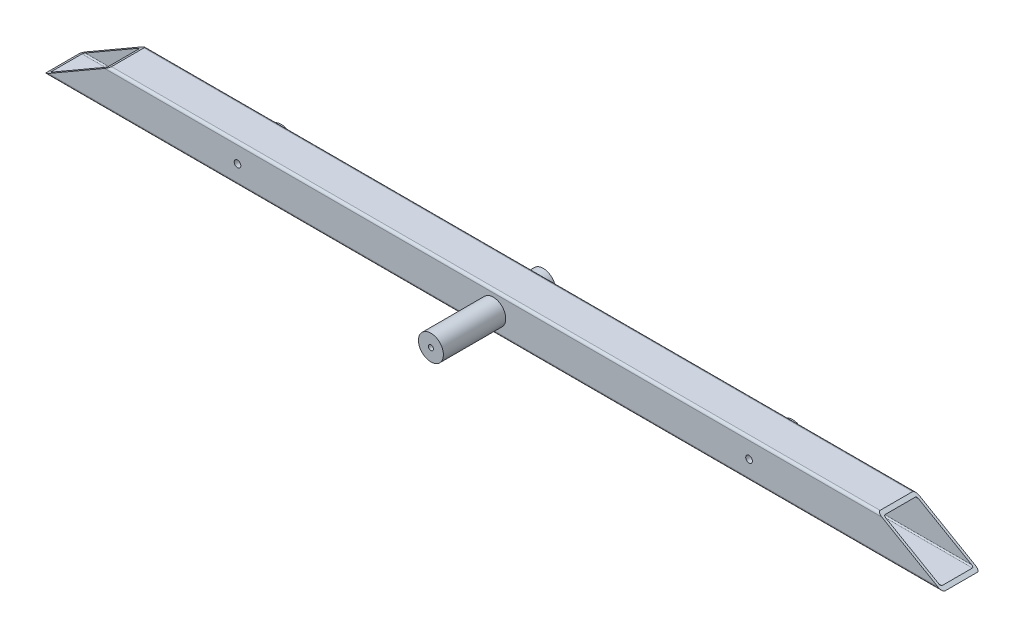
ISO-10303-21;
HEADER;
FILE_DESCRIPTION(('STEP AP214'),'2;1');
FILE_NAME('part.step','',(''),(''),'','','');
FILE_SCHEMA(('AUTOMOTIVE_DESIGN { 1 0 10303 214 1 1 1 1 }'));
ENDSEC;
DATA;
#1=APPLICATION_CONTEXT('core data for automotive mechanical design processes');
#2=APPLICATION_PROTOCOL_DEFINITION('international standard','automotive_design',2000,#1);
#3=PRODUCT_CONTEXT('',#1,'mechanical');
#4=PRODUCT('Part','Part','',(#3));
#5=PRODUCT_RELATED_PRODUCT_CATEGORY('part','',(#4));
#6=PRODUCT_DEFINITION_FORMATION('','',#4);
#7=PRODUCT_DEFINITION_CONTEXT('part definition',#1,'design');
#8=PRODUCT_DEFINITION('design','',#6,#7);
#9=PRODUCT_DEFINITION_SHAPE('','',#8);
#10=(LENGTH_UNIT() NAMED_UNIT(*) SI_UNIT(.MILLI.,.METRE.));
#11=(NAMED_UNIT(*) PLANE_ANGLE_UNIT() SI_UNIT($,.RADIAN.));
#12=(NAMED_UNIT(*) SI_UNIT($,.STERADIAN.) SOLID_ANGLE_UNIT());
#13=UNCERTAINTY_MEASURE_WITH_UNIT(LENGTH_MEASURE(1.E-05),#10,'distance_accuracy_value','');
#14=(GEOMETRIC_REPRESENTATION_CONTEXT(3) GLOBAL_UNCERTAINTY_ASSIGNED_CONTEXT((#13)) GLOBAL_UNIT_ASSIGNED_CONTEXT((#10,
#11,#12)) REPRESENTATION_CONTEXT('',''));
#15=CARTESIAN_POINT('',(0.,0.,0.));
#16=DIRECTION('',(0.,0.,1.));
#17=DIRECTION('',(1.,0.,0.));
#18=AXIS2_PLACEMENT_3D('',#15,#16,#17);
#19=CARTESIAN_POINT('',(457.2,16.51,19.05));
#20=DIRECTION('',(0.,0.,-1.));
#21=DIRECTION('',(-1.,0.,0.));
#22=AXIS2_PLACEMENT_3D('',#19,#20,#21);
#23=PLANE('',#22);
#24=CARTESIAN_POINT('',(260.35,0.,19.05));
#25=DIRECTION('',(0.,0.,-1.));
#26=DIRECTION('',(-1.,0.,0.));
#27=AXIS2_PLACEMENT_3D('',#24,#25,#26);
#28=CIRCLE('',#27,3.3782);
#29=CARTESIAN_POINT('',(256.9718,0.,19.05));
#30=VERTEX_POINT('',#29);
#31=EDGE_CURVE('E346',#30,#30,#28,.T.);
#32=ORIENTED_EDGE('',*,*,#31,.T.);
#33=EDGE_LOOP('',(#32));
#34=FACE_BOUND('',#33,.T.);
#35=CARTESIAN_POINT('',(-260.35,0.,19.05));
#36=DIRECTION('',(0.,0.,-1.));
#37=DIRECTION('',(-1.,0.,0.));
#38=AXIS2_PLACEMENT_3D('',#35,#36,#37);
#39=CIRCLE('',#38,3.3782);
#40=CARTESIAN_POINT('',(-263.7282,0.,19.05));
#41=VERTEX_POINT('',#40);
#42=EDGE_CURVE('E340',#41,#41,#39,.T.);
#43=ORIENTED_EDGE('',*,*,#42,.T.);
#44=EDGE_LOOP('',(#43));
#45=FACE_BOUND('',#44,.T.);
#46=DIRECTION('',(0.866025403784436,0.500000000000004,0.));
#47=VECTOR('',#46,1.);
#48=CARTESIAN_POINT('',(243.997931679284,385.786814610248,19.05));
#49=LINE('',#48,#47);
#50=CARTESIAN_POINT('',(-452.800590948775,-16.51,19.05));
#51=VERTEX_POINT('',#50);
#52=CARTESIAN_POINT('',(-395.608273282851,16.51,19.05));
#53=VERTEX_POINT('',#52);
#54=EDGE_CURVE('E222',#51,#53,#49,.T.);
#55=ORIENTED_EDGE('',*,*,#54,.F.);
#56=DIRECTION('',(-1.,0.,0.));
#57=VECTOR('',#56,1.);
#58=CARTESIAN_POINT('',(457.2,-16.51,19.05));
#59=LINE('',#58,#57);
#60=CARTESIAN_POINT('',(452.800590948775,-16.51,19.05));
#61=VERTEX_POINT('',#60);
#62=EDGE_CURVE('E301',#61,#51,#59,.T.);
#63=ORIENTED_EDGE('',*,*,#62,.F.);
#64=DIRECTION('',(-0.866025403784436,0.500000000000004,0.));
#65=VECTOR('',#64,1.);
#66=CARTESIAN_POINT('',(441.802068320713,-10.1599999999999,19.05));
#67=LINE('',#66,#65);
#68=CARTESIAN_POINT('',(395.608273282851,16.51,19.05));
#69=VERTEX_POINT('',#68);
#70=EDGE_CURVE('E254',#61,#69,#67,.T.);
#71=ORIENTED_EDGE('',*,*,#70,.T.);
#72=DIRECTION('',(-1.,0.,0.));
#73=VECTOR('',#72,1.);
#74=CARTESIAN_POINT('',(457.2,16.51,19.05));
#75=LINE('',#74,#73);
#76=EDGE_CURVE('E304',#69,#53,#75,.T.);
#77=ORIENTED_EDGE('',*,*,#76,.T.);
#78=EDGE_LOOP('',(#55,#63,#71,#77));
#79=FACE_BOUND('',#78,.T.);
#80=CARTESIAN_POINT('',(0.,0.,19.05));
#81=DIRECTION('',(0.,0.,-1.));
#82=DIRECTION('',(-1.,0.,0.));
#83=AXIS2_PLACEMENT_3D('',#80,#81,#82);
#84=CIRCLE('',#83,12.7);
#85=CARTESIAN_POINT('',(-12.7,0.,19.05));
#86=VERTEX_POINT('',#85);
#87=EDGE_CURVE('E188',#86,#86,#84,.F.);
#88=ORIENTED_EDGE('',*,*,#87,.F.);
#89=EDGE_LOOP('',(#88));
#90=FACE_BOUND('',#89,.T.);
#91=ADVANCED_FACE('F37',(#34,#45,#79,#90),#23,.F.);
#92=CARTESIAN_POINT('',(457.2,15.494,16.764));
#93=DIRECTION('',(0.,0.,-1.));
#94=DIRECTION('',(-1.,0.,0.));
#95=AXIS2_PLACEMENT_3D('',#92,#93,#94);
#96=PLANE('',#95);
#97=CARTESIAN_POINT('',(260.35,0.,16.764));
#98=DIRECTION('',(0.,0.,-1.));
#99=DIRECTION('',(-1.,0.,0.));
#100=AXIS2_PLACEMENT_3D('',#97,#98,#99);
#101=CIRCLE('',#100,12.7);
#102=CARTESIAN_POINT('',(247.65,0.,16.764));
#103=VERTEX_POINT('',#102);
#104=EDGE_CURVE('E11',#103,#103,#101,.T.);
#105=ORIENTED_EDGE('',*,*,#104,.F.);
#106=EDGE_LOOP('',(#105));
#107=FACE_BOUND('',#106,.T.);
#108=CARTESIAN_POINT('',(-260.35,0.,16.764));
#109=DIRECTION('',(0.,0.,-1.));
#110=DIRECTION('',(-1.,0.,0.));
#111=AXIS2_PLACEMENT_3D('',#108,#109,#110);
#112=CIRCLE('',#111,12.7);
#113=CARTESIAN_POINT('',(-273.05,0.,16.764));
#114=VERTEX_POINT('',#113);
#115=EDGE_CURVE('E321',#114,#114,#112,.T.);
#116=ORIENTED_EDGE('',*,*,#115,.F.);
#117=EDGE_LOOP('',(#116));
#118=FACE_BOUND('',#117,.T.);
#119=DIRECTION('',(-1.,0.,0.));
#120=VECTOR('',#119,1.);
#121=CARTESIAN_POINT('',(457.2,-15.494,16.764));
#122=LINE('',#121,#120);
#123=CARTESIAN_POINT('',(451.040827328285,-15.494,16.764));
#124=VERTEX_POINT('',#123);
#125=CARTESIAN_POINT('',(-451.040827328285,-15.494,16.764));
#126=VERTEX_POINT('',#125);
#127=EDGE_CURVE('E272',#124,#126,#122,.T.);
#128=ORIENTED_EDGE('',*,*,#127,.T.);
#129=DIRECTION('',(0.866025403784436,0.500000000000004,0.));
#130=VECTOR('',#129,1.);
#131=CARTESIAN_POINT('',(243.557990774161,385.532814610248,16.764));
#132=LINE('',#131,#130);
#133=CARTESIAN_POINT('',(-397.368036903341,15.494,16.764));
#134=VERTEX_POINT('',#133);
#135=EDGE_CURVE('E203',#126,#134,#132,.T.);
#136=ORIENTED_EDGE('',*,*,#135,.T.);
#137=DIRECTION('',(-1.,0.,0.));
#138=VECTOR('',#137,1.);
#139=CARTESIAN_POINT('',(457.2,15.494,16.764));
#140=LINE('',#139,#138);
#141=CARTESIAN_POINT('',(397.368036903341,15.494,16.764));
#142=VERTEX_POINT('',#141);
#143=EDGE_CURVE('E275',#142,#134,#140,.T.);
#144=ORIENTED_EDGE('',*,*,#143,.F.);
#145=DIRECTION('',(-0.866025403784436,0.500000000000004,0.));
#146=VECTOR('',#145,1.);
#147=CARTESIAN_POINT('',(442.242009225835,-10.4139999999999,16.764));
#148=LINE('',#147,#146);
#149=EDGE_CURVE('E234',#124,#142,#148,.T.);
#150=ORIENTED_EDGE('',*,*,#149,.F.);
#151=EDGE_LOOP('',(#128,#136,#144,#150));
#152=FACE_BOUND('',#151,.T.);
#153=CARTESIAN_POINT('',(0.,0.,16.764));
#154=DIRECTION('',(0.,0.,-1.));
#155=DIRECTION('',(-1.,0.,0.));
#156=AXIS2_PLACEMENT_3D('',#153,#154,#155);
#157=CIRCLE('',#156,12.7);
#158=CARTESIAN_POINT('',(-12.7,0.,16.764));
#159=VERTEX_POINT('',#158);
#160=EDGE_CURVE('E187',#159,#159,#157,.F.);
#161=ORIENTED_EDGE('',*,*,#160,.T.);
#162=EDGE_LOOP('',(#161));
#163=FACE_BOUND('',#162,.T.);
#164=ADVANCED_FACE('F422',(#107,#118,#152,#163),#96,.T.);
#165=CARTESIAN_POINT('',(457.2,16.51,-16.51));
#166=DIRECTION('',(-1.,0.,0.));
#167=DIRECTION('',(0.,0.,1.));
#168=AXIS2_PLACEMENT_3D('',#165,#166,#167);
#169=CYLINDRICAL_SURFACE('',#168,2.54);
#170=CARTESIAN_POINT('',(-395.608273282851,16.51,-16.51));
#171=DIRECTION('',(-0.500000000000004,0.866025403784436,0.));
#172=DIRECTION('',(-0.866025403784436,-0.500000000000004,0.));
#173=AXIS2_PLACEMENT_3D('',#170,#171,#172);
#174=ELLIPSE('',#173,5.07999999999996,2.54);
#175=CARTESIAN_POINT('',(-391.208864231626,19.05,-16.51));
#176=VERTEX_POINT('',#175);
#177=CARTESIAN_POINT('',(-395.608273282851,16.51,-19.05));
#178=VERTEX_POINT('',#177);
#179=EDGE_CURVE('E53',#176,#178,#174,.T.);
#180=ORIENTED_EDGE('',*,*,#179,.F.);
#181=DIRECTION('',(-1.,0.,0.));
#182=VECTOR('',#181,1.);
#183=CARTESIAN_POINT('',(457.2,19.05,-16.51));
#184=LINE('',#183,#182);
#185=CARTESIAN_POINT('',(391.208864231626,19.05,-16.51));
#186=VERTEX_POINT('',#185);
#187=EDGE_CURVE('E310',#186,#176,#184,.T.);
#188=ORIENTED_EDGE('',*,*,#187,.F.);
#189=CARTESIAN_POINT('',(395.608273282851,16.51,-16.51));
#190=DIRECTION('',(-0.500000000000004,-0.866025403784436,0.));
#191=DIRECTION('',(-0.866025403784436,0.500000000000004,0.));
#192=AXIS2_PLACEMENT_3D('',#189,#190,#191);
#193=ELLIPSE('',#192,5.07999999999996,2.54);
#194=CARTESIAN_POINT('',(395.608273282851,16.51,-19.05));
#195=VERTEX_POINT('',#194);
#196=EDGE_CURVE('E248',#186,#195,#193,.T.);
#197=ORIENTED_EDGE('',*,*,#196,.T.);
#198=DIRECTION('',(-1.,0.,0.));
#199=VECTOR('',#198,1.);
#200=CARTESIAN_POINT('',(457.2,16.51,-19.05));
#201=LINE('',#200,#199);
#202=EDGE_CURVE('E287',#195,#178,#201,.T.);
#203=ORIENTED_EDGE('',*,*,#202,.T.);
#204=EDGE_LOOP('',(#180,#188,#197,#203));
#205=FACE_BOUND('',#204,.T.);
#206=ADVANCED_FACE('F39',(#205),#169,.T.);
#207=CARTESIAN_POINT('',(457.2,19.05,16.51));
#208=DIRECTION('',(0.,-1.,0.));
#209=DIRECTION('',(0.,0.,-1.));
#210=AXIS2_PLACEMENT_3D('',#207,#208,#209);
#211=PLANE('',#210);
#212=DIRECTION('',(0.,0.,1.));
#213=VECTOR('',#212,1.);
#214=CARTESIAN_POINT('',(-391.208864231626,19.05,-25.4));
#215=LINE('',#214,#213);
#216=CARTESIAN_POINT('',(-391.208864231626,19.05,16.51));
#217=VERTEX_POINT('',#216);
#218=EDGE_CURVE('E193',#176,#217,#215,.T.);
#219=ORIENTED_EDGE('',*,*,#218,.T.);
#220=DIRECTION('',(-1.,0.,0.));
#221=VECTOR('',#220,1.);
#222=CARTESIAN_POINT('',(457.2,19.05,16.51));
#223=LINE('',#222,#221);
#224=CARTESIAN_POINT('',(391.208864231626,19.05,16.51));
#225=VERTEX_POINT('',#224);
#226=EDGE_CURVE('E307',#225,#217,#223,.T.);
#227=ORIENTED_EDGE('',*,*,#226,.F.);
#228=DIRECTION('',(0.,0.,1.));
#229=VECTOR('',#228,1.);
#230=CARTESIAN_POINT('',(391.208864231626,19.05,-25.4));
#231=LINE('',#230,#229);
#232=EDGE_CURVE('E226',#186,#225,#231,.T.);
#233=ORIENTED_EDGE('',*,*,#232,.F.);
#234=ORIENTED_EDGE('',*,*,#187,.T.);
#235=EDGE_LOOP('',(#219,#227,#233,#234));
#236=FACE_BOUND('',#235,.T.);
#237=ADVANCED_FACE('F390',(#236),#211,.F.);
#238=CARTESIAN_POINT('',(457.2,16.51,16.51));
#239=DIRECTION('',(-1.,0.,0.));
#240=DIRECTION('',(0.,0.,1.));
#241=AXIS2_PLACEMENT_3D('',#238,#239,#240);
#242=CYLINDRICAL_SURFACE('',#241,2.54);
#243=CARTESIAN_POINT('',(-395.608273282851,16.51,16.51));
#244=DIRECTION('',(-0.500000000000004,0.866025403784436,0.));
#245=DIRECTION('',(-0.866025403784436,-0.500000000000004,0.));
#246=AXIS2_PLACEMENT_3D('',#243,#244,#245);
#247=ELLIPSE('',#246,5.07999999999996,2.54);
#248=EDGE_CURVE('E224',#53,#217,#247,.T.);
#249=ORIENTED_EDGE('',*,*,#248,.F.);
#250=ORIENTED_EDGE('',*,*,#76,.F.);
#251=CARTESIAN_POINT('',(395.608273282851,16.51,16.51));
#252=DIRECTION('',(-0.500000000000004,-0.866025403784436,0.));
#253=DIRECTION('',(-0.866025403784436,0.500000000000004,0.));
#254=AXIS2_PLACEMENT_3D('',#251,#252,#253);
#255=ELLIPSE('',#254,5.07999999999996,2.54);
#256=EDGE_CURVE('E257',#69,#225,#255,.T.);
#257=ORIENTED_EDGE('',*,*,#256,.T.);
#258=ORIENTED_EDGE('',*,*,#226,.T.);
#259=EDGE_LOOP('',(#249,#250,#257,#258));
#260=FACE_BOUND('',#259,.T.);
#261=ADVANCED_FACE('F393',(#260),#242,.T.);
#262=CARTESIAN_POINT('',(457.2,-16.51,16.51));
#263=DIRECTION('',(-1.,0.,0.));
#264=DIRECTION('',(0.,0.,1.));
#265=AXIS2_PLACEMENT_3D('',#262,#263,#264);
#266=CYLINDRICAL_SURFACE('',#265,2.54);
#267=CARTESIAN_POINT('',(-452.800590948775,-16.51,16.51));
#268=DIRECTION('',(-0.500000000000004,0.866025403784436,0.));
#269=DIRECTION('',(-0.866025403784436,-0.500000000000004,0.));
#270=AXIS2_PLACEMENT_3D('',#267,#268,#269);
#271=ELLIPSE('',#270,5.07999999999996,2.54);
#272=CARTESIAN_POINT('',(-457.2,-19.05,16.51));
#273=VERTEX_POINT('',#272);
#274=EDGE_CURVE('E220',#273,#51,#271,.T.);
#275=ORIENTED_EDGE('',*,*,#274,.F.);
#276=DIRECTION('',(-1.,0.,0.));
#277=VECTOR('',#276,1.);
#278=CARTESIAN_POINT('',(457.2,-19.05,16.51));
#279=LINE('',#278,#277);
#280=CARTESIAN_POINT('',(457.2,-19.05,16.51));
#281=VERTEX_POINT('',#280);
#282=EDGE_CURVE('E298',#281,#273,#279,.T.);
#283=ORIENTED_EDGE('',*,*,#282,.F.);
#284=CARTESIAN_POINT('',(452.800590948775,-16.51,16.51));
#285=DIRECTION('',(-0.500000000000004,-0.866025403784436,0.));
#286=DIRECTION('',(-0.866025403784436,0.500000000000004,0.));
#287=AXIS2_PLACEMENT_3D('',#284,#285,#286);
#288=ELLIPSE('',#287,5.07999999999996,2.54);
#289=EDGE_CURVE('E251',#281,#61,#288,.T.);
#290=ORIENTED_EDGE('',*,*,#289,.T.);
#291=ORIENTED_EDGE('',*,*,#62,.T.);
#292=EDGE_LOOP('',(#275,#283,#290,#291));
#293=FACE_BOUND('',#292,.T.);
#294=ADVANCED_FACE('F401',(#293),#266,.T.);
#295=CARTESIAN_POINT('',(457.2,-16.51,-16.51));
#296=DIRECTION('',(-1.,0.,0.));
#297=DIRECTION('',(0.,0.,1.));
#298=AXIS2_PLACEMENT_3D('',#295,#296,#297);
#299=CYLINDRICAL_SURFACE('',#298,2.54);
#300=CARTESIAN_POINT('',(-452.800590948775,-16.51,-16.51));
#301=DIRECTION('',(-0.500000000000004,0.866025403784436,0.));
#302=DIRECTION('',(-0.866025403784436,-0.500000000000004,0.));
#303=AXIS2_PLACEMENT_3D('',#300,#301,#302);
#304=ELLIPSE('',#303,5.07999999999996,2.54);
#305=CARTESIAN_POINT('',(-452.800590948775,-16.51,-19.05));
#306=VERTEX_POINT('',#305);
#307=CARTESIAN_POINT('',(-457.2,-19.05,-16.51));
#308=VERTEX_POINT('',#307);
#309=EDGE_CURVE('E217',#306,#308,#304,.T.);
#310=ORIENTED_EDGE('',*,*,#309,.F.);
#311=DIRECTION('',(-1.,0.,0.));
#312=VECTOR('',#311,1.);
#313=CARTESIAN_POINT('',(457.2,-16.51,-19.05));
#314=LINE('',#313,#312);
#315=CARTESIAN_POINT('',(452.800590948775,-16.51,-19.05));
#316=VERTEX_POINT('',#315);
#317=EDGE_CURVE('E292',#316,#306,#314,.T.);
#318=ORIENTED_EDGE('',*,*,#317,.F.);
#319=CARTESIAN_POINT('',(452.800590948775,-16.51,-16.51));
#320=DIRECTION('',(-0.500000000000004,-0.866025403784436,0.));
#321=DIRECTION('',(-0.866025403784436,0.500000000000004,0.));
#322=AXIS2_PLACEMENT_3D('',#319,#320,#321);
#323=ELLIPSE('',#322,5.07999999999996,2.54);
#324=CARTESIAN_POINT('',(457.2,-19.05,-16.51));
#325=VERTEX_POINT('',#324);
#326=EDGE_CURVE('E245',#316,#325,#323,.T.);
#327=ORIENTED_EDGE('',*,*,#326,.T.);
#328=DIRECTION('',(-1.,0.,0.));
#329=VECTOR('',#328,1.);
#330=CARTESIAN_POINT('',(457.2,-19.05,-16.51));
#331=LINE('',#330,#329);
#332=EDGE_CURVE('E295',#325,#308,#331,.T.);
#333=ORIENTED_EDGE('',*,*,#332,.T.);
#334=EDGE_LOOP('',(#310,#318,#327,#333));
#335=FACE_BOUND('',#334,.T.);
#336=ADVANCED_FACE('F374',(#335),#299,.T.);
#337=CARTESIAN_POINT('',(457.2,16.51,-19.05));
#338=DIRECTION('',(0.,0.,1.));
#339=DIRECTION('',(0.,-1.,0.));
#340=AXIS2_PLACEMENT_3D('',#337,#338,#339);
#341=PLANE('',#340);
#342=CARTESIAN_POINT('',(260.35,0.,-19.05));
#343=DIRECTION('',(0.,0.,1.));
#344=DIRECTION('',(0.,-1.,0.));
#345=AXIS2_PLACEMENT_3D('',#342,#343,#344);
#346=CIRCLE('',#345,12.7);
#347=CARTESIAN_POINT('',(260.35,-12.7,-19.05));
#348=VERTEX_POINT('',#347);
#349=EDGE_CURVE('E333',#348,#348,#346,.T.);
#350=ORIENTED_EDGE('',*,*,#349,.T.);
#351=EDGE_LOOP('',(#350));
#352=FACE_BOUND('',#351,.T.);
#353=CARTESIAN_POINT('',(-260.35,0.,-19.05));
#354=DIRECTION('',(0.,0.,1.));
#355=DIRECTION('',(0.,-1.,0.));
#356=AXIS2_PLACEMENT_3D('',#353,#354,#355);
#357=CIRCLE('',#356,12.7);
#358=CARTESIAN_POINT('',(-260.35,-12.7,-19.05));
#359=VERTEX_POINT('',#358);
#360=EDGE_CURVE('E172',#359,#359,#357,.T.);
#361=ORIENTED_EDGE('',*,*,#360,.T.);
#362=EDGE_LOOP('',(#361));
#363=FACE_BOUND('',#362,.T.);
#364=CARTESIAN_POINT('',(0.,0.,-19.05));
#365=DIRECTION('',(0.,0.,1.));
#366=DIRECTION('',(0.,-1.,0.));
#367=AXIS2_PLACEMENT_3D('',#364,#365,#366);
#368=CIRCLE('',#367,12.7);
#369=CARTESIAN_POINT('',(0.,-12.7,-19.05));
#370=VERTEX_POINT('',#369);
#371=EDGE_CURVE('E181',#370,#370,#368,.T.);
#372=ORIENTED_EDGE('',*,*,#371,.T.);
#373=EDGE_LOOP('',(#372));
#374=FACE_BOUND('',#373,.T.);
#375=DIRECTION('',(-0.866025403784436,-0.500000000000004,0.));
#376=VECTOR('',#375,1.);
#377=CARTESIAN_POINT('',(243.997931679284,385.786814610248,-19.05));
#378=LINE('',#377,#376);
#379=EDGE_CURVE('E215',#178,#306,#378,.T.);
#380=ORIENTED_EDGE('',*,*,#379,.F.);
#381=ORIENTED_EDGE('',*,*,#202,.F.);
#382=DIRECTION('',(0.866025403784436,-0.500000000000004,0.));
#383=VECTOR('',#382,1.);
#384=CARTESIAN_POINT('',(441.802068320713,-10.1599999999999,-19.05));
#385=LINE('',#384,#383);
#386=EDGE_CURVE('E242',#195,#316,#385,.T.);
#387=ORIENTED_EDGE('',*,*,#386,.T.);
#388=ORIENTED_EDGE('',*,*,#317,.T.);
#389=EDGE_LOOP('',(#380,#381,#387,#388));
#390=FACE_BOUND('',#389,.T.);
#391=ADVANCED_FACE('F370',(#352,#363,#374,#390),#341,.F.);
#392=CARTESIAN_POINT('',(457.2,15.494,-15.494));
#393=DIRECTION('',(-1.,0.,0.));
#394=DIRECTION('',(0.,0.,1.));
#395=AXIS2_PLACEMENT_3D('',#392,#393,#394);
#396=CYLINDRICAL_SURFACE('',#395,1.27);
#397=DIRECTION('',(-1.,0.,0.));
#398=VECTOR('',#397,1.);
#399=CARTESIAN_POINT('',(457.2,16.764,-15.494));
#400=LINE('',#399,#398);
#401=CARTESIAN_POINT('',(395.168332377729,16.764,-15.494));
#402=VERTEX_POINT('',#401);
#403=CARTESIAN_POINT('',(-395.168332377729,16.764,-15.494));
#404=VERTEX_POINT('',#403);
#405=EDGE_CURVE('E281',#402,#404,#400,.T.);
#406=ORIENTED_EDGE('',*,*,#405,.T.);
#407=CARTESIAN_POINT('',(-397.368036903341,15.494,-15.494));
#408=DIRECTION('',(-0.500000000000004,0.866025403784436,0.));
#409=DIRECTION('',(-0.866025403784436,-0.500000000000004,0.));
#410=AXIS2_PLACEMENT_3D('',#407,#408,#409);
#411=ELLIPSE('',#410,2.53999999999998,1.27);
#412=CARTESIAN_POINT('',(-397.368036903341,15.494,-16.764));
#413=VERTEX_POINT('',#412);
#414=EDGE_CURVE('E212',#404,#413,#411,.T.);
#415=ORIENTED_EDGE('',*,*,#414,.T.);
#416=DIRECTION('',(-1.,0.,0.));
#417=VECTOR('',#416,1.);
#418=CARTESIAN_POINT('',(457.2,15.494,-16.764));
#419=LINE('',#418,#417);
#420=CARTESIAN_POINT('',(397.368036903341,15.494,-16.764));
#421=VERTEX_POINT('',#420);
#422=EDGE_CURVE('E260',#421,#413,#419,.T.);
#423=ORIENTED_EDGE('',*,*,#422,.F.);
#424=CARTESIAN_POINT('',(397.368036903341,15.494,-15.494));
#425=DIRECTION('',(-0.500000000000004,-0.866025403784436,0.));
#426=DIRECTION('',(-0.866025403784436,0.500000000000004,0.));
#427=AXIS2_PLACEMENT_3D('',#424,#425,#426);
#428=ELLIPSE('',#427,2.53999999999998,1.27);
#429=EDGE_CURVE('E240',#402,#421,#428,.T.);
#430=ORIENTED_EDGE('',*,*,#429,.F.);
#431=EDGE_LOOP('',(#406,#415,#423,#430));
#432=FACE_BOUND('',#431,.T.);
#433=ADVANCED_FACE('F373',(#432),#396,.F.);
#434=CARTESIAN_POINT('',(457.2,16.764,15.494));
#435=DIRECTION('',(0.,-1.,0.));
#436=DIRECTION('',(0.,0.,-1.));
#437=AXIS2_PLACEMENT_3D('',#434,#435,#436);
#438=PLANE('',#437);
#439=DIRECTION('',(-1.,0.,0.));
#440=VECTOR('',#439,1.);
#441=CARTESIAN_POINT('',(457.2,16.764,15.494));
#442=LINE('',#441,#440);
#443=CARTESIAN_POINT('',(395.168332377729,16.764,15.494));
#444=VERTEX_POINT('',#443);
#445=CARTESIAN_POINT('',(-395.168332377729,16.764,15.494));
#446=VERTEX_POINT('',#445);
#447=EDGE_CURVE('E278',#444,#446,#442,.T.);
#448=ORIENTED_EDGE('',*,*,#447,.T.);
#449=DIRECTION('',(0.,0.,-1.));
#450=VECTOR('',#449,1.);
#451=CARTESIAN_POINT('',(-395.168332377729,16.764,15.4940000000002));
#452=LINE('',#451,#450);
#453=EDGE_CURVE('E209',#446,#404,#452,.T.);
#454=ORIENTED_EDGE('',*,*,#453,.T.);
#455=ORIENTED_EDGE('',*,*,#405,.F.);
#456=DIRECTION('',(0.,0.,-1.));
#457=VECTOR('',#456,1.);
#458=CARTESIAN_POINT('',(395.168332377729,16.764,15.494));
#459=LINE('',#458,#457);
#460=EDGE_CURVE('E238',#444,#402,#459,.T.);
#461=ORIENTED_EDGE('',*,*,#460,.F.);
#462=EDGE_LOOP('',(#448,#454,#455,#461));
#463=FACE_BOUND('',#462,.T.);
#464=ADVANCED_FACE('F622',(#463),#438,.T.);
#465=CARTESIAN_POINT('',(457.2,15.494,15.494));
#466=DIRECTION('',(-1.,0.,0.));
#467=DIRECTION('',(0.,0.,1.));
#468=AXIS2_PLACEMENT_3D('',#465,#466,#467);
#469=CYLINDRICAL_SURFACE('',#468,1.27);
#470=ORIENTED_EDGE('',*,*,#143,.T.);
#471=CARTESIAN_POINT('',(-397.368036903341,15.494,15.494));
#472=DIRECTION('',(-0.500000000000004,0.866025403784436,0.));
#473=DIRECTION('',(-0.866025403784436,-0.500000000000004,0.));
#474=AXIS2_PLACEMENT_3D('',#471,#472,#473);
#475=ELLIPSE('',#474,2.53999999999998,1.27);
#476=EDGE_CURVE('E206',#134,#446,#475,.T.);
#477=ORIENTED_EDGE('',*,*,#476,.T.);
#478=ORIENTED_EDGE('',*,*,#447,.F.);
#479=CARTESIAN_POINT('',(397.368036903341,15.494,15.494));
#480=DIRECTION('',(-0.500000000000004,-0.866025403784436,0.));
#481=DIRECTION('',(-0.866025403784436,0.500000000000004,0.));
#482=AXIS2_PLACEMENT_3D('',#479,#480,#481);
#483=ELLIPSE('',#482,2.53999999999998,1.27);
#484=EDGE_CURVE('E236',#142,#444,#483,.T.);
#485=ORIENTED_EDGE('',*,*,#484,.F.);
#486=EDGE_LOOP('',(#470,#477,#478,#485));
#487=FACE_BOUND('',#486,.T.);
#488=ADVANCED_FACE('F629',(#487),#469,.F.);
#489=CARTESIAN_POINT('',(457.2,-15.494,15.494));
#490=DIRECTION('',(-1.,0.,0.));
#491=DIRECTION('',(0.,0.,1.));
#492=AXIS2_PLACEMENT_3D('',#489,#490,#491);
#493=CYLINDRICAL_SURFACE('',#492,1.27);
#494=DIRECTION('',(-1.,0.,0.));
#495=VECTOR('',#494,1.);
#496=CARTESIAN_POINT('',(457.2,-16.764,15.494));
#497=LINE('',#496,#495);
#498=CARTESIAN_POINT('',(453.240531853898,-16.764,15.494));
#499=VERTEX_POINT('',#498);
#500=CARTESIAN_POINT('',(-453.240531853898,-16.764,15.494));
#501=VERTEX_POINT('',#500);
#502=EDGE_CURVE('E269',#499,#501,#497,.T.);
#503=ORIENTED_EDGE('',*,*,#502,.T.);
#504=CARTESIAN_POINT('',(-451.040827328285,-15.494,15.494));
#505=DIRECTION('',(-0.500000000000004,0.866025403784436,0.));
#506=DIRECTION('',(-0.866025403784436,-0.500000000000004,0.));
#507=AXIS2_PLACEMENT_3D('',#504,#505,#506);
#508=ELLIPSE('',#507,2.53999999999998,1.27);
#509=EDGE_CURVE('E200',#501,#126,#508,.T.);
#510=ORIENTED_EDGE('',*,*,#509,.T.);
#511=ORIENTED_EDGE('',*,*,#127,.F.);
#512=CARTESIAN_POINT('',(451.040827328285,-15.494,15.494));
#513=DIRECTION('',(-0.500000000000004,-0.866025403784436,0.));
#514=DIRECTION('',(-0.866025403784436,0.500000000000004,0.));
#515=AXIS2_PLACEMENT_3D('',#512,#513,#514);
#516=ELLIPSE('',#515,2.53999999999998,1.27);
#517=EDGE_CURVE('E232',#499,#124,#516,.T.);
#518=ORIENTED_EDGE('',*,*,#517,.F.);
#519=EDGE_LOOP('',(#503,#510,#511,#518));
#520=FACE_BOUND('',#519,.T.);
#521=ADVANCED_FACE('F637',(#520),#493,.F.);
#522=CARTESIAN_POINT('',(457.2,-16.764,15.494));
#523=DIRECTION('',(0.,1.,0.));
#524=DIRECTION('',(0.,0.,1.));
#525=AXIS2_PLACEMENT_3D('',#522,#523,#524);
#526=PLANE('',#525);
#527=DIRECTION('',(-1.,0.,0.));
#528=VECTOR('',#527,1.);
#529=CARTESIAN_POINT('',(457.2,-16.764,-15.494));
#530=LINE('',#529,#528);
#531=CARTESIAN_POINT('',(453.240531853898,-16.764,-15.494));
#532=VERTEX_POINT('',#531);
#533=CARTESIAN_POINT('',(-453.240531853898,-16.764,-15.494));
#534=VERTEX_POINT('',#533);
#535=EDGE_CURVE('E266',#532,#534,#530,.T.);
#536=ORIENTED_EDGE('',*,*,#535,.T.);
#537=DIRECTION('',(0.,0.,1.));
#538=VECTOR('',#537,1.);
#539=CARTESIAN_POINT('',(-453.240531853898,-16.764,15.4939999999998));
#540=LINE('',#539,#538);
#541=EDGE_CURVE('E197',#534,#501,#540,.T.);
#542=ORIENTED_EDGE('',*,*,#541,.T.);
#543=ORIENTED_EDGE('',*,*,#502,.F.);
#544=DIRECTION('',(0.,0.,1.));
#545=VECTOR('',#544,1.);
#546=CARTESIAN_POINT('',(453.240531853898,-16.764,15.494));
#547=LINE('',#546,#545);
#548=EDGE_CURVE('E230',#532,#499,#547,.T.);
#549=ORIENTED_EDGE('',*,*,#548,.F.);
#550=EDGE_LOOP('',(#536,#542,#543,#549));
#551=FACE_BOUND('',#550,.T.);
#552=ADVANCED_FACE('F645',(#551),#526,.T.);
#553=CARTESIAN_POINT('',(457.2,-15.494,-15.494));
#554=DIRECTION('',(-1.,0.,0.));
#555=DIRECTION('',(0.,0.,1.));
#556=AXIS2_PLACEMENT_3D('',#553,#554,#555);
#557=CYLINDRICAL_SURFACE('',#556,1.27);
#558=DIRECTION('',(-1.,0.,0.));
#559=VECTOR('',#558,1.);
#560=CARTESIAN_POINT('',(457.2,-15.494,-16.764));
#561=LINE('',#560,#559);
#562=CARTESIAN_POINT('',(451.040827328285,-15.494,-16.764));
#563=VERTEX_POINT('',#562);
#564=CARTESIAN_POINT('',(-451.040827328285,-15.494,-16.764));
#565=VERTEX_POINT('',#564);
#566=EDGE_CURVE('E263',#563,#565,#561,.T.);
#567=ORIENTED_EDGE('',*,*,#566,.T.);
#568=CARTESIAN_POINT('',(-451.040827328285,-15.494,-15.494));
#569=DIRECTION('',(-0.500000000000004,0.866025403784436,0.));
#570=DIRECTION('',(-0.866025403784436,-0.500000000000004,0.));
#571=AXIS2_PLACEMENT_3D('',#568,#569,#570);
#572=ELLIPSE('',#571,2.53999999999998,1.27);
#573=EDGE_CURVE('E61',#565,#534,#572,.T.);
#574=ORIENTED_EDGE('',*,*,#573,.T.);
#575=ORIENTED_EDGE('',*,*,#535,.F.);
#576=CARTESIAN_POINT('',(451.040827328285,-15.494,-15.494));
#577=DIRECTION('',(-0.500000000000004,-0.866025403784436,0.));
#578=DIRECTION('',(-0.866025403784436,0.500000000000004,0.));
#579=AXIS2_PLACEMENT_3D('',#576,#577,#578);
#580=ELLIPSE('',#579,2.53999999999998,1.27);
#581=EDGE_CURVE('E228',#563,#532,#580,.T.);
#582=ORIENTED_EDGE('',*,*,#581,.F.);
#583=EDGE_LOOP('',(#567,#574,#575,#582));
#584=FACE_BOUND('',#583,.T.);
#585=ADVANCED_FACE('F599',(#584),#557,.F.);
#586=CARTESIAN_POINT('',(457.2,15.494,-16.764));
#587=DIRECTION('',(0.,0.,1.));
#588=DIRECTION('',(0.,-1.,0.));
#589=AXIS2_PLACEMENT_3D('',#586,#587,#588);
#590=PLANE('',#589);
#591=CARTESIAN_POINT('',(260.35,0.,-16.764));
#592=DIRECTION('',(0.,0.,1.));
#593=DIRECTION('',(0.,-1.,0.));
#594=AXIS2_PLACEMENT_3D('',#591,#592,#593);
#595=CIRCLE('',#594,12.7);
#596=CARTESIAN_POINT('',(260.35,-12.7,-16.764));
#597=VERTEX_POINT('',#596);
#598=EDGE_CURVE('E41',#597,#597,#595,.T.);
#599=ORIENTED_EDGE('',*,*,#598,.F.);
#600=EDGE_LOOP('',(#599));
#601=FACE_BOUND('',#600,.T.);
#602=CARTESIAN_POINT('',(-260.35,0.,-16.764));
#603=DIRECTION('',(0.,0.,1.));
#604=DIRECTION('',(0.,-1.,0.));
#605=AXIS2_PLACEMENT_3D('',#602,#603,#604);
#606=CIRCLE('',#605,12.7);
#607=CARTESIAN_POINT('',(-260.35,-12.7,-16.764));
#608=VERTEX_POINT('',#607);
#609=EDGE_CURVE('E319',#608,#608,#606,.T.);
#610=ORIENTED_EDGE('',*,*,#609,.F.);
#611=EDGE_LOOP('',(#610));
#612=FACE_BOUND('',#611,.T.);
#613=CARTESIAN_POINT('',(0.,0.,-16.764));
#614=DIRECTION('',(0.,0.,1.));
#615=DIRECTION('',(0.,-1.,0.));
#616=AXIS2_PLACEMENT_3D('',#613,#614,#615);
#617=CIRCLE('',#616,12.7);
#618=CARTESIAN_POINT('',(0.,-12.7,-16.764));
#619=VERTEX_POINT('',#618);
#620=EDGE_CURVE('E191',#619,#619,#617,.T.);
#621=ORIENTED_EDGE('',*,*,#620,.F.);
#622=EDGE_LOOP('',(#621));
#623=FACE_BOUND('',#622,.T.);
#624=ORIENTED_EDGE('',*,*,#422,.T.);
#625=DIRECTION('',(-0.866025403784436,-0.500000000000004,0.));
#626=VECTOR('',#625,1.);
#627=CARTESIAN_POINT('',(243.557990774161,385.532814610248,-16.7640000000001));
#628=LINE('',#627,#626);
#629=EDGE_CURVE('E192',#413,#565,#628,.T.);
#630=ORIENTED_EDGE('',*,*,#629,.T.);
#631=ORIENTED_EDGE('',*,*,#566,.F.);
#632=DIRECTION('',(0.866025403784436,-0.500000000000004,0.));
#633=VECTOR('',#632,1.);
#634=CARTESIAN_POINT('',(442.242009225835,-10.4139999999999,-16.764));
#635=LINE('',#634,#633);
#636=EDGE_CURVE('E313',#421,#563,#635,.T.);
#637=ORIENTED_EDGE('',*,*,#636,.F.);
#638=EDGE_LOOP('',(#624,#630,#631,#637));
#639=FACE_BOUND('',#638,.T.);
#640=ADVANCED_FACE('F596',(#601,#612,#623,#639),#590,.T.);
#641=CARTESIAN_POINT('',(457.2,-19.05,16.51));
#642=DIRECTION('',(0.,1.,0.));
#643=DIRECTION('',(0.,0.,1.));
#644=AXIS2_PLACEMENT_3D('',#641,#642,#643);
#645=PLANE('',#644);
#646=DIRECTION('',(0.,0.,-1.));
#647=VECTOR('',#646,1.);
#648=CARTESIAN_POINT('',(-457.2,-19.05,16.51));
#649=LINE('',#648,#647);
#650=EDGE_CURVE('E284',#273,#308,#649,.T.);
#651=ORIENTED_EDGE('',*,*,#650,.T.);
#652=ORIENTED_EDGE('',*,*,#332,.F.);
#653=DIRECTION('',(0.,0.,-1.));
#654=VECTOR('',#653,1.);
#655=CARTESIAN_POINT('',(457.2,-19.05,16.51));
#656=LINE('',#655,#654);
#657=EDGE_CURVE('E285',#281,#325,#656,.T.);
#658=ORIENTED_EDGE('',*,*,#657,.F.);
#659=ORIENTED_EDGE('',*,*,#282,.T.);
#660=EDGE_LOOP('',(#651,#652,#658,#659));
#661=FACE_BOUND('',#660,.T.);
#662=ADVANCED_FACE('F407',(#661),#645,.F.);
#663=CARTESIAN_POINT('',(391.208864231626,19.05,-25.4));
#664=DIRECTION('',(-0.500000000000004,-0.866025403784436,0.));
#665=DIRECTION('',(0.866025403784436,-0.500000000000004,0.));
#666=AXIS2_PLACEMENT_3D('',#663,#664,#665);
#667=PLANE('',#666);
#668=ORIENTED_EDGE('',*,*,#429,.T.);
#669=ORIENTED_EDGE('',*,*,#636,.T.);
#670=ORIENTED_EDGE('',*,*,#581,.T.);
#671=ORIENTED_EDGE('',*,*,#548,.T.);
#672=ORIENTED_EDGE('',*,*,#517,.T.);
#673=ORIENTED_EDGE('',*,*,#149,.T.);
#674=ORIENTED_EDGE('',*,*,#484,.T.);
#675=ORIENTED_EDGE('',*,*,#460,.T.);
#676=EDGE_LOOP('',(#668,#669,#670,#671,#672,#673,#674,#675));
#677=FACE_BOUND('',#676,.T.);
#678=ORIENTED_EDGE('',*,*,#70,.F.);
#679=ORIENTED_EDGE('',*,*,#289,.F.);
#680=ORIENTED_EDGE('',*,*,#657,.T.);
#681=ORIENTED_EDGE('',*,*,#326,.F.);
#682=ORIENTED_EDGE('',*,*,#386,.F.);
#683=ORIENTED_EDGE('',*,*,#196,.F.);
#684=ORIENTED_EDGE('',*,*,#232,.T.);
#685=ORIENTED_EDGE('',*,*,#256,.F.);
#686=EDGE_LOOP('',(#678,#679,#680,#681,#682,#683,#684,#685));
#687=FACE_BOUND('',#686,.T.);
#688=ADVANCED_FACE('F387',(#677,#687),#667,.F.);
#689=CARTESIAN_POINT('',(-391.208864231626,19.05,-25.4));
#690=DIRECTION('',(-0.500000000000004,0.866025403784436,0.));
#691=DIRECTION('',(-0.866025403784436,-0.500000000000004,0.));
#692=AXIS2_PLACEMENT_3D('',#689,#690,#691);
#693=PLANE('',#692);
#694=ORIENTED_EDGE('',*,*,#453,.F.);
#695=ORIENTED_EDGE('',*,*,#476,.F.);
#696=ORIENTED_EDGE('',*,*,#135,.F.);
#697=ORIENTED_EDGE('',*,*,#509,.F.);
#698=ORIENTED_EDGE('',*,*,#541,.F.);
#699=ORIENTED_EDGE('',*,*,#573,.F.);
#700=ORIENTED_EDGE('',*,*,#629,.F.);
#701=ORIENTED_EDGE('',*,*,#414,.F.);
#702=EDGE_LOOP('',(#694,#695,#696,#697,#698,#699,#700,#701));
#703=FACE_BOUND('',#702,.T.);
#704=ORIENTED_EDGE('',*,*,#248,.T.);
#705=ORIENTED_EDGE('',*,*,#218,.F.);
#706=ORIENTED_EDGE('',*,*,#179,.T.);
#707=ORIENTED_EDGE('',*,*,#379,.T.);
#708=ORIENTED_EDGE('',*,*,#309,.T.);
#709=ORIENTED_EDGE('',*,*,#650,.F.);
#710=ORIENTED_EDGE('',*,*,#274,.T.);
#711=ORIENTED_EDGE('',*,*,#54,.T.);
#712=EDGE_LOOP('',(#704,#705,#706,#707,#708,#709,#710,#711));
#713=FACE_BOUND('',#712,.T.);
#714=ADVANCED_FACE('F408',(#703,#713),#693,.T.);
#715=CARTESIAN_POINT('',(0.,0.,82.55));
#716=DIRECTION('',(0.,0.,-1.));
#717=DIRECTION('',(-1.,0.,0.));
#718=AXIS2_PLACEMENT_3D('',#715,#716,#717);
#719=CYLINDRICAL_SURFACE('',#718,12.7);
#720=ORIENTED_EDGE('',*,*,#160,.F.);
#721=EDGE_LOOP('',(#720));
#722=FACE_BOUND('',#721,.T.);
#723=ORIENTED_EDGE('',*,*,#620,.T.);
#724=EDGE_LOOP('',(#723));
#725=FACE_BOUND('',#724,.T.);
#726=ADVANCED_FACE('F410',(#722,#725),#719,.T.);
#727=CARTESIAN_POINT('',(0.,0.,82.55));
#728=DIRECTION('',(0.,0.,1.));
#729=DIRECTION('',(1.,0.,0.));
#730=AXIS2_PLACEMENT_3D('',#727,#728,#729);
#731=CIRCLE('',#730,12.7);
#732=CARTESIAN_POINT('',(12.7,0.,82.55));
#733=VERTEX_POINT('',#732);
#734=EDGE_CURVE('E184',#733,#733,#731,.T.);
#735=ORIENTED_EDGE('',*,*,#734,.F.);
#736=EDGE_LOOP('',(#735));
#737=FACE_BOUND('',#736,.T.);
#738=ORIENTED_EDGE('',*,*,#87,.T.);
#739=EDGE_LOOP('',(#738));
#740=FACE_BOUND('',#739,.T.);
#741=ADVANCED_FACE('F416',(#737,#740),#719,.T.);
#742=CARTESIAN_POINT('',(0.,0.,82.55));
#743=DIRECTION('',(0.,0.,1.));
#744=DIRECTION('',(1.,0.,0.));
#745=AXIS2_PLACEMENT_3D('',#742,#743,#744);
#746=PLANE('',#745);
#747=CARTESIAN_POINT('',(0.,0.,82.55));
#748=DIRECTION('',(0.,0.,1.));
#749=DIRECTION('',(1.,0.,0.));
#750=AXIS2_PLACEMENT_3D('',#747,#748,#749);
#751=CIRCLE('',#750,2.5527);
#752=CARTESIAN_POINT('',(2.5527,0.,82.55));
#753=VERTEX_POINT('',#752);
#754=EDGE_CURVE('E166',#753,#753,#751,.T.);
#755=ORIENTED_EDGE('',*,*,#754,.F.);
#756=EDGE_LOOP('',(#755));
#757=FACE_BOUND('',#756,.T.);
#758=ORIENTED_EDGE('',*,*,#734,.T.);
#759=EDGE_LOOP('',(#758));
#760=FACE_BOUND('',#759,.T.);
#761=ADVANCED_FACE('F472',(#757,#760),#746,.T.);
#762=CARTESIAN_POINT('',(0.,0.,-31.75));
#763=DIRECTION('',(0.,0.,1.));
#764=DIRECTION('',(1.,0.,0.));
#765=AXIS2_PLACEMENT_3D('',#762,#763,#764);
#766=CYLINDRICAL_SURFACE('',#765,12.7);
#767=CARTESIAN_POINT('',(0.,0.,-31.75));
#768=DIRECTION('',(0.,0.,1.));
#769=DIRECTION('',(1.,0.,0.));
#770=AXIS2_PLACEMENT_3D('',#767,#768,#769);
#771=CIRCLE('',#770,12.7);
#772=CARTESIAN_POINT('',(12.7,0.,-31.75));
#773=VERTEX_POINT('',#772);
#774=EDGE_CURVE('E178',#773,#773,#771,.T.);
#775=ORIENTED_EDGE('',*,*,#774,.T.);
#776=EDGE_LOOP('',(#775));
#777=FACE_BOUND('',#776,.T.);
#778=ORIENTED_EDGE('',*,*,#371,.F.);
#779=EDGE_LOOP('',(#778));
#780=FACE_BOUND('',#779,.T.);
#781=ADVANCED_FACE('F479',(#777,#780),#766,.T.);
#782=CARTESIAN_POINT('',(0.,0.,-31.75));
#783=DIRECTION('',(0.,0.,1.));
#784=DIRECTION('',(1.,0.,0.));
#785=AXIS2_PLACEMENT_3D('',#782,#783,#784);
#786=PLANE('',#785);
#787=CARTESIAN_POINT('',(0.,0.,-31.75));
#788=DIRECTION('',(0.,0.,-1.));
#789=DIRECTION('',(-1.,0.,0.));
#790=AXIS2_PLACEMENT_3D('',#787,#788,#789);
#791=CIRCLE('',#790,3.96875);
#792=CARTESIAN_POINT('',(-3.96875,0.,-31.75));
#793=VERTEX_POINT('',#792);
#794=EDGE_CURVE('E165',#793,#793,#791,.T.);
#795=ORIENTED_EDGE('',*,*,#794,.F.);
#796=EDGE_LOOP('',(#795));
#797=FACE_BOUND('',#796,.T.);
#798=ORIENTED_EDGE('',*,*,#774,.F.);
#799=EDGE_LOOP('',(#798));
#800=FACE_BOUND('',#799,.T.);
#801=ADVANCED_FACE('F519',(#797,#800),#786,.F.);
#802=CARTESIAN_POINT('',(0.,0.,-4.7498));
#803=DIRECTION('',(0.,0.,-1.));
#804=DIRECTION('',(-1.,0.,0.));
#805=AXIS2_PLACEMENT_3D('',#802,#803,#804);
#806=CONICAL_SURFACE('',#805,3.96875,1.02974425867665);
#807=CARTESIAN_POINT('',(0.,0.,-2.36513441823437));
#808=VERTEX_POINT('',#807);
#809=VERTEX_LOOP('',#808);
#810=FACE_BOUND('',#809,.T.);
#811=CARTESIAN_POINT('',(0.,0.,-4.7498));
#812=DIRECTION('',(0.,0.,-1.));
#813=DIRECTION('',(-1.,0.,0.));
#814=AXIS2_PLACEMENT_3D('',#811,#812,#813);
#815=CIRCLE('',#814,3.96875);
#816=CARTESIAN_POINT('',(-3.96875,0.,-4.7498));
#817=VERTEX_POINT('',#816);
#818=EDGE_CURVE('E169',#817,#817,#815,.T.);
#819=ORIENTED_EDGE('',*,*,#818,.T.);
#820=EDGE_LOOP('',(#819));
#821=FACE_BOUND('',#820,.T.);
#822=ADVANCED_FACE('F511',(#810,#821),#806,.F.);
#823=CARTESIAN_POINT('',(0.,0.,-31.75));
#824=DIRECTION('',(0.,0.,-1.));
#825=DIRECTION('',(-1.,0.,0.));
#826=AXIS2_PLACEMENT_3D('',#823,#824,#825);
#827=CYLINDRICAL_SURFACE('',#826,3.96875);
#828=ORIENTED_EDGE('',*,*,#818,.F.);
#829=EDGE_LOOP('',(#828));
#830=FACE_BOUND('',#829,.T.);
#831=ORIENTED_EDGE('',*,*,#794,.T.);
#832=EDGE_LOOP('',(#831));
#833=FACE_BOUND('',#832,.T.);
#834=ADVANCED_FACE('F159',(#830,#833),#827,.F.);
#835=CARTESIAN_POINT('',(0.,0.,63.5));
#836=DIRECTION('',(0.,0.,1.));
#837=DIRECTION('',(1.,0.,0.));
#838=AXIS2_PLACEMENT_3D('',#835,#836,#837);
#839=CONICAL_SURFACE('',#838,2.55269999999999,1.02974425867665);
#840=CARTESIAN_POINT('',(0.,0.,61.9661830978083));
#841=VERTEX_POINT('',#840);
#842=VERTEX_LOOP('',#841);
#843=FACE_BOUND('',#842,.T.);
#844=CARTESIAN_POINT('',(0.,0.,63.5));
#845=DIRECTION('',(0.,0.,1.));
#846=DIRECTION('',(1.,0.,0.));
#847=AXIS2_PLACEMENT_3D('',#844,#845,#846);
#848=CIRCLE('',#847,2.55269999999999);
#849=CARTESIAN_POINT('',(2.55269999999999,0.,63.5));
#850=VERTEX_POINT('',#849);
#851=EDGE_CURVE('E163',#850,#850,#848,.T.);
#852=ORIENTED_EDGE('',*,*,#851,.T.);
#853=EDGE_LOOP('',(#852));
#854=FACE_BOUND('',#853,.T.);
#855=ADVANCED_FACE('F155',(#843,#854),#839,.F.);
#856=CARTESIAN_POINT('',(0.,0.,82.55));
#857=DIRECTION('',(0.,0.,1.));
#858=DIRECTION('',(1.,0.,0.));
#859=AXIS2_PLACEMENT_3D('',#856,#857,#858);
#860=CYLINDRICAL_SURFACE('',#859,2.5527);
#861=ORIENTED_EDGE('',*,*,#851,.F.);
#862=EDGE_LOOP('',(#861));
#863=FACE_BOUND('',#862,.T.);
#864=ORIENTED_EDGE('',*,*,#754,.T.);
#865=EDGE_LOOP('',(#864));
#866=FACE_BOUND('',#865,.T.);
#867=ADVANCED_FACE('F158',(#863,#866),#860,.F.);
#868=CARTESIAN_POINT('',(-260.35,0.,-25.4));
#869=DIRECTION('',(0.,0.,1.));
#870=DIRECTION('',(1.,0.,0.));
#871=AXIS2_PLACEMENT_3D('',#868,#869,#870);
#872=CYLINDRICAL_SURFACE('',#871,12.7);
#873=ORIENTED_EDGE('',*,*,#115,.T.);
#874=EDGE_LOOP('',(#873));
#875=FACE_BOUND('',#874,.T.);
#876=ORIENTED_EDGE('',*,*,#609,.T.);
#877=EDGE_LOOP('',(#876));
#878=FACE_BOUND('',#877,.T.);
#879=ADVANCED_FACE('F501',(#875,#878),#872,.T.);
#880=CARTESIAN_POINT('',(-260.35,0.,-25.4));
#881=DIRECTION('',(0.,0.,1.));
#882=DIRECTION('',(1.,0.,0.));
#883=AXIS2_PLACEMENT_3D('',#880,#881,#882);
#884=CIRCLE('',#883,12.7);
#885=CARTESIAN_POINT('',(-247.65,0.,-25.4));
#886=VERTEX_POINT('',#885);
#887=EDGE_CURVE('E331',#886,#886,#884,.T.);
#888=ORIENTED_EDGE('',*,*,#887,.T.);
#889=EDGE_LOOP('',(#888));
#890=FACE_BOUND('',#889,.T.);
#891=ORIENTED_EDGE('',*,*,#360,.F.);
#892=EDGE_LOOP('',(#891));
#893=FACE_BOUND('',#892,.T.);
#894=ADVANCED_FACE('F550',(#890,#893),#872,.T.);
#895=CARTESIAN_POINT('',(-260.35,0.,-25.4));
#896=DIRECTION('',(0.,0.,1.));
#897=DIRECTION('',(1.,0.,0.));
#898=AXIS2_PLACEMENT_3D('',#895,#896,#897);
#899=PLANE('',#898);
#900=CARTESIAN_POINT('',(-260.35,0.,-25.4));
#901=DIRECTION('',(0.,0.,-1.));
#902=DIRECTION('',(-1.,0.,0.));
#903=AXIS2_PLACEMENT_3D('',#900,#901,#902);
#904=CIRCLE('',#903,3.3782);
#905=CARTESIAN_POINT('',(-263.7282,0.,-25.4));
#906=VERTEX_POINT('',#905);
#907=EDGE_CURVE('E343',#906,#906,#904,.T.);
#908=ORIENTED_EDGE('',*,*,#907,.F.);
#909=EDGE_LOOP('',(#908));
#910=FACE_BOUND('',#909,.T.);
#911=ORIENTED_EDGE('',*,*,#887,.F.);
#912=EDGE_LOOP('',(#911));
#913=FACE_BOUND('',#912,.T.);
#914=ADVANCED_FACE('F551',(#910,#913),#899,.F.);
#915=CARTESIAN_POINT('',(260.35,0.,-25.4));
#916=DIRECTION('',(0.,0.,1.));
#917=DIRECTION('',(1.,0.,0.));
#918=AXIS2_PLACEMENT_3D('',#915,#916,#917);
#919=CYLINDRICAL_SURFACE('',#918,12.7);
#920=ORIENTED_EDGE('',*,*,#104,.T.);
#921=EDGE_LOOP('',(#920));
#922=FACE_BOUND('',#921,.T.);
#923=ORIENTED_EDGE('',*,*,#598,.T.);
#924=EDGE_LOOP('',(#923));
#925=FACE_BOUND('',#924,.T.);
#926=ADVANCED_FACE('F366',(#922,#925),#919,.T.);
#927=CARTESIAN_POINT('',(260.35,0.,-25.4));
#928=DIRECTION('',(0.,0.,1.));
#929=DIRECTION('',(1.,0.,0.));
#930=AXIS2_PLACEMENT_3D('',#927,#928,#929);
#931=CIRCLE('',#930,12.7);
#932=CARTESIAN_POINT('',(273.05,0.,-25.4));
#933=VERTEX_POINT('',#932);
#934=EDGE_CURVE('E337',#933,#933,#931,.T.);
#935=ORIENTED_EDGE('',*,*,#934,.T.);
#936=EDGE_LOOP('',(#935));
#937=FACE_BOUND('',#936,.T.);
#938=ORIENTED_EDGE('',*,*,#349,.F.);
#939=EDGE_LOOP('',(#938));
#940=FACE_BOUND('',#939,.T.);
#941=ADVANCED_FACE('F360',(#937,#940),#919,.T.);
#942=CARTESIAN_POINT('',(260.35,0.,-25.4));
#943=DIRECTION('',(0.,0.,1.));
#944=DIRECTION('',(1.,0.,0.));
#945=AXIS2_PLACEMENT_3D('',#942,#943,#944);
#946=PLANE('',#945);
#947=CARTESIAN_POINT('',(260.35,0.,-25.4));
#948=DIRECTION('',(0.,0.,-1.));
#949=DIRECTION('',(-1.,0.,0.));
#950=AXIS2_PLACEMENT_3D('',#947,#948,#949);
#951=CIRCLE('',#950,3.3782);
#952=CARTESIAN_POINT('',(256.9718,0.,-25.4));
#953=VERTEX_POINT('',#952);
#954=EDGE_CURVE('E349',#953,#953,#951,.T.);
#955=ORIENTED_EDGE('',*,*,#954,.F.);
#956=EDGE_LOOP('',(#955));
#957=FACE_BOUND('',#956,.T.);
#958=ORIENTED_EDGE('',*,*,#934,.F.);
#959=EDGE_LOOP('',(#958));
#960=FACE_BOUND('',#959,.T.);
#961=ADVANCED_FACE('F356',(#957,#960),#946,.F.);
#962=CARTESIAN_POINT('',(-260.35,0.,-25.4));
#963=DIRECTION('',(0.,0.,-1.));
#964=DIRECTION('',(-1.,0.,0.));
#965=AXIS2_PLACEMENT_3D('',#962,#963,#964);
#966=CYLINDRICAL_SURFACE('',#965,3.3782);
#967=ORIENTED_EDGE('',*,*,#907,.T.);
#968=EDGE_LOOP('',(#967));
#969=FACE_BOUND('',#968,.T.);
#970=ORIENTED_EDGE('',*,*,#42,.F.);
#971=EDGE_LOOP('',(#970));
#972=FACE_BOUND('',#971,.T.);
#973=ADVANCED_FACE('F359',(#969,#972),#966,.F.);
#974=CARTESIAN_POINT('',(260.35,0.,-25.4));
#975=DIRECTION('',(0.,0.,-1.));
#976=DIRECTION('',(-1.,0.,0.));
#977=AXIS2_PLACEMENT_3D('',#974,#975,#976);
#978=CYLINDRICAL_SURFACE('',#977,3.3782);
#979=ORIENTED_EDGE('',*,*,#954,.T.);
#980=EDGE_LOOP('',(#979));
#981=FACE_BOUND('',#980,.T.);
#982=ORIENTED_EDGE('',*,*,#31,.F.);
#983=EDGE_LOOP('',(#982));
#984=FACE_BOUND('',#983,.T.);
#985=ADVANCED_FACE('F353',(#981,#984),#978,.F.);
#986=CLOSED_SHELL('',(#91,#164,#206,#237,#261,#294,#336,#391,#433,#464,#488,#521,#552,#585,#640,
#662,#688,#714,#726,#741,#761,#781,#801,#822,#834,#855,#867,#879,#894,#914,#926,#941,#961,#973,#985));
#987=MANIFOLD_SOLID_BREP('B2',#986);
#988=ADVANCED_BREP_SHAPE_REPRESENTATION('',(#18,#987),#14);
#989=SHAPE_DEFINITION_REPRESENTATION(#9,#988);
ENDSEC;
END-ISO-10303-21;
